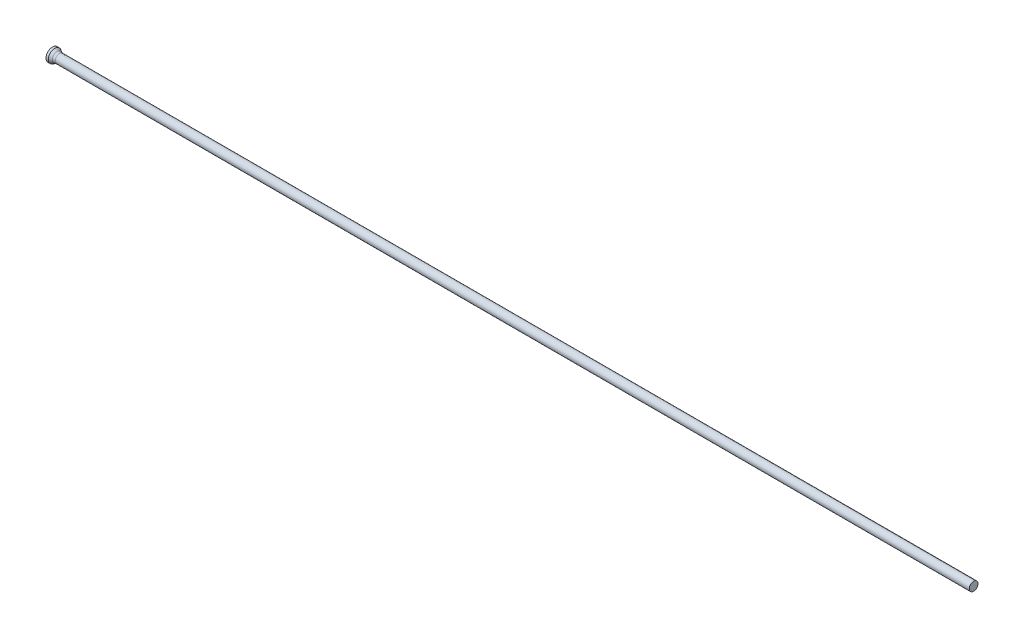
ISO-10303-21;
HEADER;
FILE_DESCRIPTION(('STEP AP214'),'2;1');
FILE_NAME('part.step','',(''),(''),'','','');
FILE_SCHEMA(('AUTOMOTIVE_DESIGN { 1 0 10303 214 1 1 1 1 }'));
ENDSEC;
DATA;
#1=APPLICATION_CONTEXT('core data for automotive mechanical design processes');
#2=APPLICATION_PROTOCOL_DEFINITION('international standard','automotive_design',2000,#1);
#3=PRODUCT_CONTEXT('',#1,'mechanical');
#4=PRODUCT('Part','Part','',(#3));
#5=PRODUCT_RELATED_PRODUCT_CATEGORY('part','',(#4));
#6=PRODUCT_DEFINITION_FORMATION('','',#4);
#7=PRODUCT_DEFINITION_CONTEXT('part definition',#1,'design');
#8=PRODUCT_DEFINITION('design','',#6,#7);
#9=PRODUCT_DEFINITION_SHAPE('','',#8);
#10=(LENGTH_UNIT() NAMED_UNIT(*) SI_UNIT(.MILLI.,.METRE.));
#11=(NAMED_UNIT(*) PLANE_ANGLE_UNIT() SI_UNIT($,.RADIAN.));
#12=(NAMED_UNIT(*) SI_UNIT($,.STERADIAN.) SOLID_ANGLE_UNIT());
#13=UNCERTAINTY_MEASURE_WITH_UNIT(LENGTH_MEASURE(1.E-05),#10,'distance_accuracy_value','');
#14=(GEOMETRIC_REPRESENTATION_CONTEXT(3) GLOBAL_UNCERTAINTY_ASSIGNED_CONTEXT((#13)) GLOBAL_UNIT_ASSIGNED_CONTEXT((#10,
#11,#12)) REPRESENTATION_CONTEXT('',''));
#15=CARTESIAN_POINT('',(0.,0.,0.));
#16=DIRECTION('',(0.,0.,1.));
#17=DIRECTION('',(1.,0.,0.));
#18=AXIS2_PLACEMENT_3D('',#15,#16,#17);
#19=CARTESIAN_POINT('',(0.,0.,0.));
#20=DIRECTION('',(1.,0.,0.));
#21=DIRECTION('',(0.,0.,-1.));
#22=AXIS2_PLACEMENT_3D('',#19,#20,#21);
#23=PLANE('',#22);
#24=CARTESIAN_POINT('',(0.,0.,0.));
#25=DIRECTION('',(-1.,0.,0.));
#26=DIRECTION('',(0.,0.,1.));
#27=AXIS2_PLACEMENT_3D('',#24,#25,#26);
#28=CIRCLE('',#27,1.4);
#29=CARTESIAN_POINT('',(0.,0.,1.4));
#30=VERTEX_POINT('',#29);
#31=EDGE_CURVE('E25',#30,#30,#28,.T.);
#32=ORIENTED_EDGE('',*,*,#31,.T.);
#33=EDGE_LOOP('',(#32));
#34=FACE_BOUND('',#33,.T.);
#35=ADVANCED_FACE('F14',(#34),#23,.F.);
#36=CARTESIAN_POINT('',(0.,0.,0.));
#37=DIRECTION('',(-1.,0.,0.));
#38=DIRECTION('',(0.,0.,1.));
#39=AXIS2_PLACEMENT_3D('',#36,#37,#38);
#40=CYLINDRICAL_SURFACE('',#39,1.4);
#41=ORIENTED_EDGE('',*,*,#31,.F.);
#42=EDGE_LOOP('',(#41));
#43=FACE_BOUND('',#42,.T.);
#44=CARTESIAN_POINT('',(0.500577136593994,0.,0.));
#45=DIRECTION('',(-1.,0.,0.));
#46=DIRECTION('',(0.,0.,1.));
#47=AXIS2_PLACEMENT_3D('',#44,#45,#46);
#48=CIRCLE('',#47,1.4);
#49=CARTESIAN_POINT('',(0.500577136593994,0.,1.4));
#50=VERTEX_POINT('',#49);
#51=EDGE_CURVE('E29',#50,#50,#48,.T.);
#52=ORIENTED_EDGE('',*,*,#51,.T.);
#53=EDGE_LOOP('',(#52));
#54=FACE_BOUND('',#53,.T.);
#55=ADVANCED_FACE('F53',(#43,#54),#40,.T.);
#56=CARTESIAN_POINT('',(1.28,0.,0.));
#57=DIRECTION('',(-1.,0.,0.));
#58=DIRECTION('',(0.,0.,1.));
#59=AXIS2_PLACEMENT_3D('',#56,#57,#58);
#60=CONICAL_SURFACE('',#59,0.95,0.523598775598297);
#61=CARTESIAN_POINT('',(1.04794919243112,0.,0.));
#62=DIRECTION('',(-1.,0.,0.));
#63=DIRECTION('',(0.,0.,1.));
#64=AXIS2_PLACEMENT_3D('',#61,#62,#63);
#65=CIRCLE('',#64,1.08397459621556);
#66=CARTESIAN_POINT('',(1.04794919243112,0.,1.08397459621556));
#67=VERTEX_POINT('',#66);
#68=EDGE_CURVE('E21',#67,#67,#65,.T.);
#69=ORIENTED_EDGE('',*,*,#68,.T.);
#70=EDGE_LOOP('',(#69));
#71=FACE_BOUND('',#70,.T.);
#72=ORIENTED_EDGE('',*,*,#51,.F.);
#73=EDGE_LOOP('',(#72));
#74=FACE_BOUND('',#73,.T.);
#75=ADVANCED_FACE('F50',(#71,#74),#60,.T.);
#76=CARTESIAN_POINT('',(0.,0.,0.));
#77=DIRECTION('',(-1.,0.,0.));
#78=DIRECTION('',(0.,0.,1.));
#79=AXIS2_PLACEMENT_3D('',#76,#77,#78);
#80=CYLINDRICAL_SURFACE('',#79,0.95);
#81=CARTESIAN_POINT('',(1.54794919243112,0.,0.));
#82=DIRECTION('',(-1.,0.,0.));
#83=DIRECTION('',(0.,0.,1.));
#84=AXIS2_PLACEMENT_3D('',#81,#82,#83);
#85=CIRCLE('',#84,0.95);
#86=CARTESIAN_POINT('',(1.54794919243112,0.,0.95));
#87=VERTEX_POINT('',#86);
#88=EDGE_CURVE('E9',#87,#87,#85,.F.);
#89=ORIENTED_EDGE('',*,*,#88,.T.);
#90=EDGE_LOOP('',(#89));
#91=FACE_BOUND('',#90,.T.);
#92=CARTESIAN_POINT('',(200.,0.,0.));
#93=DIRECTION('',(-1.,0.,0.));
#94=DIRECTION('',(0.,0.,1.));
#95=AXIS2_PLACEMENT_3D('',#92,#93,#94);
#96=CIRCLE('',#95,0.95);
#97=CARTESIAN_POINT('',(200.,0.,0.95));
#98=VERTEX_POINT('',#97);
#99=EDGE_CURVE('E34',#98,#98,#96,.T.);
#100=ORIENTED_EDGE('',*,*,#99,.T.);
#101=EDGE_LOOP('',(#100));
#102=FACE_BOUND('',#101,.T.);
#103=ADVANCED_FACE('F38',(#91,#102),#80,.T.);
#104=CARTESIAN_POINT('',(200.,0.95,0.));
#105=DIRECTION('',(-1.,0.,0.));
#106=DIRECTION('',(0.,0.,1.));
#107=AXIS2_PLACEMENT_3D('',#104,#105,#106);
#108=PLANE('',#107);
#109=ORIENTED_EDGE('',*,*,#99,.F.);
#110=EDGE_LOOP('',(#109));
#111=FACE_BOUND('',#110,.T.);
#112=ADVANCED_FACE('F40',(#111),#108,.F.);
#113=CARTESIAN_POINT('',(1.54794919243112,0.,0.));
#114=DIRECTION('',(-1.,0.,0.));
#115=DIRECTION('',(0.,0.,1.));
#116=AXIS2_PLACEMENT_3D('',#113,#114,#115);
#117=TOROIDAL_SURFACE('',#116,1.95,1.);
#118=ORIENTED_EDGE('',*,*,#88,.F.);
#119=EDGE_LOOP('',(#118));
#120=FACE_BOUND('',#119,.T.);
#121=ORIENTED_EDGE('',*,*,#68,.F.);
#122=EDGE_LOOP('',(#121));
#123=FACE_BOUND('',#122,.T.);
#124=ADVANCED_FACE('F16',(#120,#123),#117,.F.);
#125=CLOSED_SHELL('',(#35,#55,#75,#103,#112,#124));
#126=MANIFOLD_SOLID_BREP('B1',#125);
#127=ADVANCED_BREP_SHAPE_REPRESENTATION('',(#18,#126),#14);
#128=SHAPE_DEFINITION_REPRESENTATION(#9,#127);
ENDSEC;
END-ISO-10303-21;
